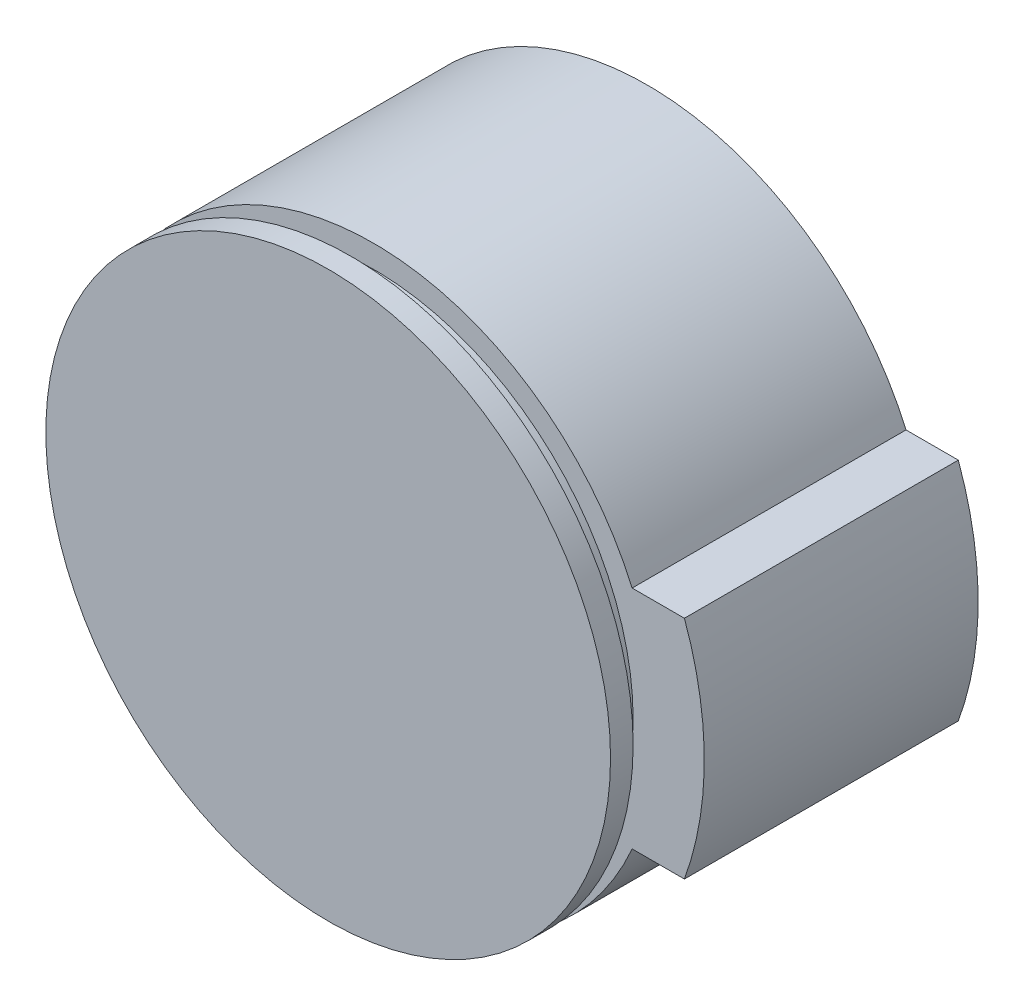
from build123d import *

# Parameters (mm, degrees)
EXTRUDE4_DEPTH = 24.25


with BuildPart() as part:
    # Sketch1 → Revolve1 (revolve)
    with BuildSketch(Plane(origin=(0, 0, 0), x_dir=(0, 0, -1), z_dir=(1, 0, 0)), mode=Mode.PRIVATE) as revolve1_sk:
        Polygon((0, 0), (0, 25), (-24.25, 25), (-24.25, 23), (-26.25, 23), (-26.25, 25), (-28.25, 25), (-28.25, 0), align=None)
    revolve(revolve1_sk.sketch.rotate(Axis((0, 0, 28.25), (0, 0, -1)), 90), axis=Axis((0, 0, 28.25), (0, 0, -1)))

    # Sketch3 → Extrude4 (add)
    with BuildSketch(Plane.XY.offset(24.25)):
        with BuildLine():
            Line((22.912878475, 10), (27.540697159, 10))
            ThreePointArc((27.540697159, 10), (29.3, 0), (27.540697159, -10))
            Line((27.540697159, -10), (22.912878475, -10))
            ThreePointArc((22.912878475, -10), (25, 0), (22.912878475, 10))
        make_face()
    extrude(amount=-EXTRUDE4_DEPTH)


solid = part.part
